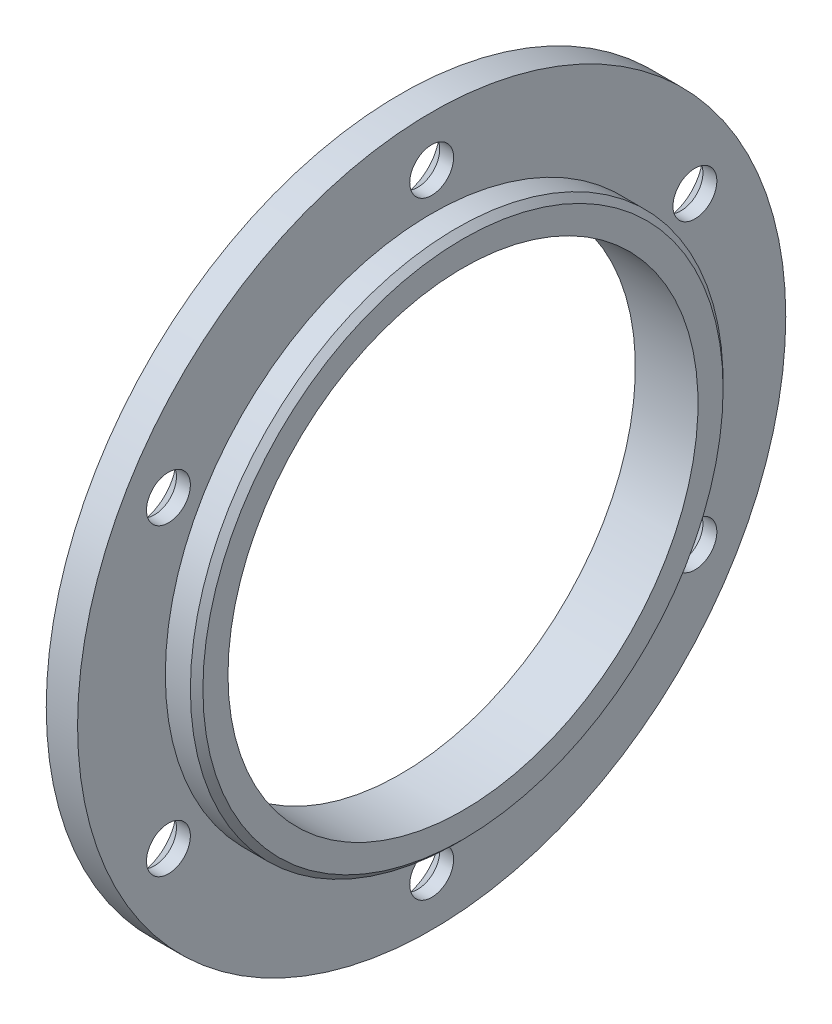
ISO-10303-21;
HEADER;
FILE_DESCRIPTION(('STEP AP214'),'2;1');
FILE_NAME('part.step','',(''),(''),'','','');
FILE_SCHEMA(('AUTOMOTIVE_DESIGN { 1 0 10303 214 1 1 1 1 }'));
ENDSEC;
DATA;
#1=APPLICATION_CONTEXT('core data for automotive mechanical design processes');
#2=APPLICATION_PROTOCOL_DEFINITION('international standard','automotive_design',2000,#1);
#3=PRODUCT_CONTEXT('',#1,'mechanical');
#4=PRODUCT('Part','Part','',(#3));
#5=PRODUCT_RELATED_PRODUCT_CATEGORY('part','',(#4));
#6=PRODUCT_DEFINITION_FORMATION('','',#4);
#7=PRODUCT_DEFINITION_CONTEXT('part definition',#1,'design');
#8=PRODUCT_DEFINITION('design','',#6,#7);
#9=PRODUCT_DEFINITION_SHAPE('','',#8);
#10=(LENGTH_UNIT() NAMED_UNIT(*) SI_UNIT(.MILLI.,.METRE.));
#11=(NAMED_UNIT(*) PLANE_ANGLE_UNIT() SI_UNIT($,.RADIAN.));
#12=(NAMED_UNIT(*) SI_UNIT($,.STERADIAN.) SOLID_ANGLE_UNIT());
#13=UNCERTAINTY_MEASURE_WITH_UNIT(LENGTH_MEASURE(1.E-05),#10,'distance_accuracy_value','');
#14=(GEOMETRIC_REPRESENTATION_CONTEXT(3) GLOBAL_UNCERTAINTY_ASSIGNED_CONTEXT((#13)) GLOBAL_UNIT_ASSIGNED_CONTEXT((#10,
#11,#12)) REPRESENTATION_CONTEXT('',''));
#15=CARTESIAN_POINT('',(0.,0.,0.));
#16=DIRECTION('',(0.,0.,1.));
#17=DIRECTION('',(1.,0.,0.));
#18=AXIS2_PLACEMENT_3D('',#15,#16,#17);
#19=CARTESIAN_POINT('',(0.,37.5,0.));
#20=DIRECTION('',(1.,0.,0.));
#21=DIRECTION('',(0.,0.,-1.));
#22=AXIS2_PLACEMENT_3D('',#19,#20,#21);
#23=PLANE('',#22);
#24=CARTESIAN_POINT('',(0.,24.2499999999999,42.0022320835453));
#25=DIRECTION('',(1.,0.,0.));
#26=DIRECTION('',(0.,0.,-1.));
#27=AXIS2_PLACEMENT_3D('',#24,#25,#26);
#28=CIRCLE('',#27,6.28000000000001);
#29=CARTESIAN_POINT('',(0.,24.2499999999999,35.7222320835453));
#30=VERTEX_POINT('',#29);
#31=EDGE_CURVE('E55',#30,#30,#28,.T.);
#32=ORIENTED_EDGE('',*,*,#31,.T.);
#33=EDGE_LOOP('',(#32));
#34=FACE_BOUND('',#33,.T.);
#35=CARTESIAN_POINT('',(0.,48.5,0.));
#36=DIRECTION('',(1.,0.,0.));
#37=DIRECTION('',(0.,0.,-1.));
#38=AXIS2_PLACEMENT_3D('',#35,#36,#37);
#39=CIRCLE('',#38,6.28000000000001);
#40=CARTESIAN_POINT('',(0.,48.5,6.28000000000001));
#41=VERTEX_POINT('',#40);
#42=EDGE_CURVE('E58',#41,#41,#39,.T.);
#43=ORIENTED_EDGE('',*,*,#42,.T.);
#44=EDGE_LOOP('',(#43));
#45=FACE_BOUND('',#44,.T.);
#46=CARTESIAN_POINT('',(0.,24.2500000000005,-42.002232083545));
#47=DIRECTION('',(1.,0.,0.));
#48=DIRECTION('',(0.,0.,-1.));
#49=AXIS2_PLACEMENT_3D('',#46,#47,#48);
#50=CIRCLE('',#49,6.28000000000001);
#51=CARTESIAN_POINT('',(0.,24.2500000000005,-35.722232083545));
#52=VERTEX_POINT('',#51);
#53=EDGE_CURVE('E61',#52,#52,#50,.T.);
#54=ORIENTED_EDGE('',*,*,#53,.T.);
#55=EDGE_LOOP('',(#54));
#56=FACE_BOUND('',#55,.T.);
#57=CARTESIAN_POINT('',(0.,-24.2499999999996,-42.0022320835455));
#58=DIRECTION('',(1.,0.,0.));
#59=DIRECTION('',(0.,0.,-1.));
#60=AXIS2_PLACEMENT_3D('',#57,#58,#59);
#61=CIRCLE('',#60,6.28);
#62=CARTESIAN_POINT('',(0.,-24.2499999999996,-35.7222320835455));
#63=VERTEX_POINT('',#62);
#64=EDGE_CURVE('E64',#63,#63,#61,.T.);
#65=ORIENTED_EDGE('',*,*,#64,.T.);
#66=EDGE_LOOP('',(#65));
#67=FACE_BOUND('',#66,.T.);
#68=CARTESIAN_POINT('',(0.,-24.2500000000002,42.0022320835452));
#69=DIRECTION('',(1.,0.,0.));
#70=DIRECTION('',(0.,0.,-1.));
#71=AXIS2_PLACEMENT_3D('',#68,#69,#70);
#72=CIRCLE('',#71,6.28000000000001);
#73=CARTESIAN_POINT('',(0.,-24.2500000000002,35.7222320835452));
#74=VERTEX_POINT('',#73);
#75=EDGE_CURVE('E67',#74,#74,#72,.T.);
#76=ORIENTED_EDGE('',*,*,#75,.T.);
#77=EDGE_LOOP('',(#76));
#78=FACE_BOUND('',#77,.T.);
#79=CARTESIAN_POINT('',(0.,-48.5,-3.3867388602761E-13));
#80=DIRECTION('',(1.,0.,0.));
#81=DIRECTION('',(0.,0.,-1.));
#82=AXIS2_PLACEMENT_3D('',#79,#80,#81);
#83=CIRCLE('',#82,6.28000000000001);
#84=CARTESIAN_POINT('',(0.,-48.5,6.27999999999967));
#85=VERTEX_POINT('',#84);
#86=EDGE_CURVE('E70',#85,#85,#83,.T.);
#87=ORIENTED_EDGE('',*,*,#86,.T.);
#88=EDGE_LOOP('',(#87));
#89=FACE_BOUND('',#88,.T.);
#90=CARTESIAN_POINT('',(0.,0.,0.));
#91=DIRECTION('',(-1.,0.,0.));
#92=DIRECTION('',(0.,0.,1.));
#93=AXIS2_PLACEMENT_3D('',#90,#91,#92);
#94=CIRCLE('',#93,37.5);
#95=CARTESIAN_POINT('',(0.,0.,37.5));
#96=VERTEX_POINT('',#95);
#97=EDGE_CURVE('E95',#96,#96,#94,.T.);
#98=ORIENTED_EDGE('',*,*,#97,.F.);
#99=EDGE_LOOP('',(#98));
#100=FACE_BOUND('',#99,.T.);
#101=CARTESIAN_POINT('',(0.,0.,0.));
#102=DIRECTION('',(-1.,0.,0.));
#103=DIRECTION('',(0.,0.,1.));
#104=AXIS2_PLACEMENT_3D('',#101,#102,#103);
#105=CIRCLE('',#104,56.5);
#106=CARTESIAN_POINT('',(0.,0.,56.5));
#107=VERTEX_POINT('',#106);
#108=EDGE_CURVE('E76',#107,#107,#105,.T.);
#109=ORIENTED_EDGE('',*,*,#108,.T.);
#110=EDGE_LOOP('',(#109));
#111=FACE_BOUND('',#110,.T.);
#112=ADVANCED_FACE('F32',(#34,#45,#56,#67,#78,#89,#100,#111),#23,.F.);
#113=CARTESIAN_POINT('',(-20.4243511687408,0.,0.));
#114=DIRECTION('',(-1.,0.,0.));
#115=DIRECTION('',(0.,0.,1.));
#116=AXIS2_PLACEMENT_3D('',#113,#114,#115);
#117=CYLINDRICAL_SURFACE('',#116,56.5);
#118=ORIENTED_EDGE('',*,*,#108,.F.);
#119=EDGE_LOOP('',(#118));
#120=FACE_BOUND('',#119,.T.);
#121=CARTESIAN_POINT('',(5.,0.,0.));
#122=DIRECTION('',(-1.,0.,0.));
#123=DIRECTION('',(0.,0.,1.));
#124=AXIS2_PLACEMENT_3D('',#121,#122,#123);
#125=CIRCLE('',#124,56.5);
#126=CARTESIAN_POINT('',(5.,0.,56.5));
#127=VERTEX_POINT('',#126);
#128=EDGE_CURVE('E98',#127,#127,#125,.T.);
#129=ORIENTED_EDGE('',*,*,#128,.T.);
#130=EDGE_LOOP('',(#129));
#131=FACE_BOUND('',#130,.T.);
#132=ADVANCED_FACE('F120',(#120,#131),#117,.T.);
#133=CARTESIAN_POINT('',(5.,42.5,0.));
#134=DIRECTION('',(-1.,0.,0.));
#135=DIRECTION('',(0.,0.,1.));
#136=AXIS2_PLACEMENT_3D('',#133,#134,#135);
#137=PLANE('',#136);
#138=CARTESIAN_POINT('',(5.,24.2500000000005,-42.002232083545));
#139=DIRECTION('',(-1.,0.,0.));
#140=DIRECTION('',(0.,0.,1.));
#141=AXIS2_PLACEMENT_3D('',#138,#139,#140);
#142=CIRCLE('',#141,3.5);
#143=CARTESIAN_POINT('',(5.,24.2500000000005,-38.502232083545));
#144=VERTEX_POINT('',#143);
#145=EDGE_CURVE('E77',#144,#144,#142,.T.);
#146=ORIENTED_EDGE('',*,*,#145,.T.);
#147=EDGE_LOOP('',(#146));
#148=FACE_BOUND('',#147,.T.);
#149=CARTESIAN_POINT('',(5.,-24.2499999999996,-42.0022320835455));
#150=DIRECTION('',(-1.,0.,0.));
#151=DIRECTION('',(0.,0.,1.));
#152=AXIS2_PLACEMENT_3D('',#149,#150,#151);
#153=CIRCLE('',#152,3.5);
#154=CARTESIAN_POINT('',(5.,-24.2499999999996,-38.5022320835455));
#155=VERTEX_POINT('',#154);
#156=EDGE_CURVE('E80',#155,#155,#153,.T.);
#157=ORIENTED_EDGE('',*,*,#156,.T.);
#158=EDGE_LOOP('',(#157));
#159=FACE_BOUND('',#158,.T.);
#160=CARTESIAN_POINT('',(5.,-48.5,-3.3867388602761E-13));
#161=DIRECTION('',(-1.,0.,0.));
#162=DIRECTION('',(0.,0.,1.));
#163=AXIS2_PLACEMENT_3D('',#160,#161,#162);
#164=CIRCLE('',#163,3.5);
#165=CARTESIAN_POINT('',(5.,-48.5,3.49999999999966));
#166=VERTEX_POINT('',#165);
#167=EDGE_CURVE('E83',#166,#166,#164,.T.);
#168=ORIENTED_EDGE('',*,*,#167,.T.);
#169=EDGE_LOOP('',(#168));
#170=FACE_BOUND('',#169,.T.);
#171=CARTESIAN_POINT('',(5.,-24.2500000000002,42.0022320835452));
#172=DIRECTION('',(-1.,0.,0.));
#173=DIRECTION('',(0.,0.,1.));
#174=AXIS2_PLACEMENT_3D('',#171,#172,#173);
#175=CIRCLE('',#174,3.5);
#176=CARTESIAN_POINT('',(5.,-24.2500000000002,45.5022320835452));
#177=VERTEX_POINT('',#176);
#178=EDGE_CURVE('E86',#177,#177,#175,.T.);
#179=ORIENTED_EDGE('',*,*,#178,.T.);
#180=EDGE_LOOP('',(#179));
#181=FACE_BOUND('',#180,.T.);
#182=CARTESIAN_POINT('',(5.,24.2499999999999,42.0022320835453));
#183=DIRECTION('',(-1.,0.,0.));
#184=DIRECTION('',(0.,0.,1.));
#185=AXIS2_PLACEMENT_3D('',#182,#183,#184);
#186=CIRCLE('',#185,3.50000000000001);
#187=CARTESIAN_POINT('',(5.,24.2499999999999,45.5022320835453));
#188=VERTEX_POINT('',#187);
#189=EDGE_CURVE('E89',#188,#188,#186,.T.);
#190=ORIENTED_EDGE('',*,*,#189,.T.);
#191=EDGE_LOOP('',(#190));
#192=FACE_BOUND('',#191,.T.);
#193=CARTESIAN_POINT('',(5.,48.5,0.));
#194=DIRECTION('',(-1.,0.,0.));
#195=DIRECTION('',(0.,0.,1.));
#196=AXIS2_PLACEMENT_3D('',#193,#194,#195);
#197=CIRCLE('',#196,3.5);
#198=CARTESIAN_POINT('',(5.,48.5,3.5));
#199=VERTEX_POINT('',#198);
#200=EDGE_CURVE('E92',#199,#199,#197,.T.);
#201=ORIENTED_EDGE('',*,*,#200,.T.);
#202=EDGE_LOOP('',(#201));
#203=FACE_BOUND('',#202,.T.);
#204=ORIENTED_EDGE('',*,*,#128,.F.);
#205=EDGE_LOOP('',(#204));
#206=FACE_BOUND('',#205,.T.);
#207=CARTESIAN_POINT('',(5.,0.,0.));
#208=DIRECTION('',(-1.,0.,0.));
#209=DIRECTION('',(0.,0.,1.));
#210=AXIS2_PLACEMENT_3D('',#207,#208,#209);
#211=CIRCLE('',#210,42.5);
#212=CARTESIAN_POINT('',(5.,0.,42.5));
#213=VERTEX_POINT('',#212);
#214=EDGE_CURVE('E101',#213,#213,#211,.T.);
#215=ORIENTED_EDGE('',*,*,#214,.T.);
#216=EDGE_LOOP('',(#215));
#217=FACE_BOUND('',#216,.T.);
#218=ADVANCED_FACE('F127',(#148,#159,#170,#181,#192,#203,#206,#217),#137,.F.);
#219=CARTESIAN_POINT('',(-20.4243511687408,0.,0.));
#220=DIRECTION('',(-1.,0.,0.));
#221=DIRECTION('',(0.,0.,1.));
#222=AXIS2_PLACEMENT_3D('',#219,#220,#221);
#223=CYLINDRICAL_SURFACE('',#222,42.5);
#224=ORIENTED_EDGE('',*,*,#214,.F.);
#225=EDGE_LOOP('',(#224));
#226=FACE_BOUND('',#225,.T.);
#227=CARTESIAN_POINT('',(9.,0.,0.));
#228=DIRECTION('',(-1.,0.,0.));
#229=DIRECTION('',(0.,0.,1.));
#230=AXIS2_PLACEMENT_3D('',#227,#228,#229);
#231=CIRCLE('',#230,42.5);
#232=CARTESIAN_POINT('',(9.,0.,42.5));
#233=VERTEX_POINT('',#232);
#234=EDGE_CURVE('E104',#233,#233,#231,.T.);
#235=ORIENTED_EDGE('',*,*,#234,.T.);
#236=EDGE_LOOP('',(#235));
#237=FACE_BOUND('',#236,.T.);
#238=ADVANCED_FACE('F133',(#226,#237),#223,.T.);
#239=CARTESIAN_POINT('',(10.,0.,0.));
#240=DIRECTION('',(-1.,0.,0.));
#241=DIRECTION('',(0.,0.,1.));
#242=AXIS2_PLACEMENT_3D('',#239,#240,#241);
#243=CONICAL_SURFACE('',#242,41.5,0.785398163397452);
#244=ORIENTED_EDGE('',*,*,#234,.F.);
#245=EDGE_LOOP('',(#244));
#246=FACE_BOUND('',#245,.T.);
#247=CARTESIAN_POINT('',(10.,0.,0.));
#248=DIRECTION('',(-1.,0.,0.));
#249=DIRECTION('',(0.,0.,1.));
#250=AXIS2_PLACEMENT_3D('',#247,#248,#249);
#251=CIRCLE('',#250,41.5);
#252=CARTESIAN_POINT('',(10.,0.,41.5));
#253=VERTEX_POINT('',#252);
#254=EDGE_CURVE('E107',#253,#253,#251,.T.);
#255=ORIENTED_EDGE('',*,*,#254,.T.);
#256=EDGE_LOOP('',(#255));
#257=FACE_BOUND('',#256,.T.);
#258=ADVANCED_FACE('F140',(#246,#257),#243,.T.);
#259=CARTESIAN_POINT('',(10.,41.5,0.));
#260=DIRECTION('',(-1.,0.,0.));
#261=DIRECTION('',(0.,0.,1.));
#262=AXIS2_PLACEMENT_3D('',#259,#260,#261);
#263=PLANE('',#262);
#264=ORIENTED_EDGE('',*,*,#254,.F.);
#265=EDGE_LOOP('',(#264));
#266=FACE_BOUND('',#265,.T.);
#267=CARTESIAN_POINT('',(10.,0.,0.));
#268=DIRECTION('',(-1.,0.,0.));
#269=DIRECTION('',(0.,0.,1.));
#270=AXIS2_PLACEMENT_3D('',#267,#268,#269);
#271=CIRCLE('',#270,37.5);
#272=CARTESIAN_POINT('',(10.,0.,37.5));
#273=VERTEX_POINT('',#272);
#274=EDGE_CURVE('E110',#273,#273,#271,.T.);
#275=ORIENTED_EDGE('',*,*,#274,.T.);
#276=EDGE_LOOP('',(#275));
#277=FACE_BOUND('',#276,.T.);
#278=ADVANCED_FACE('F146',(#266,#277),#263,.F.);
#279=CARTESIAN_POINT('',(-20.4243511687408,0.,0.));
#280=DIRECTION('',(-1.,0.,0.));
#281=DIRECTION('',(0.,0.,1.));
#282=AXIS2_PLACEMENT_3D('',#279,#280,#281);
#283=CYLINDRICAL_SURFACE('',#282,37.5);
#284=ORIENTED_EDGE('',*,*,#274,.F.);
#285=EDGE_LOOP('',(#284));
#286=FACE_BOUND('',#285,.T.);
#287=ORIENTED_EDGE('',*,*,#97,.T.);
#288=EDGE_LOOP('',(#287));
#289=FACE_BOUND('',#288,.T.);
#290=ADVANCED_FACE('F116',(#286,#289),#283,.F.);
#291=CARTESIAN_POINT('',(9.,48.5,0.));
#292=DIRECTION('',(-1.,0.,0.));
#293=DIRECTION('',(0.,0.,1.));
#294=AXIS2_PLACEMENT_3D('',#291,#292,#293);
#295=CYLINDRICAL_SURFACE('',#294,3.5);
#296=CARTESIAN_POINT('',(2.78,48.5,0.));
#297=DIRECTION('',(1.,0.,0.));
#298=DIRECTION('',(0.,0.,-1.));
#299=AXIS2_PLACEMENT_3D('',#296,#297,#298);
#300=CIRCLE('',#299,3.5);
#301=CARTESIAN_POINT('',(2.78,48.5,3.5));
#302=VERTEX_POINT('',#301);
#303=EDGE_CURVE('E52',#302,#302,#300,.F.);
#304=ORIENTED_EDGE('',*,*,#303,.T.);
#305=EDGE_LOOP('',(#304));
#306=FACE_BOUND('',#305,.T.);
#307=ORIENTED_EDGE('',*,*,#200,.F.);
#308=EDGE_LOOP('',(#307));
#309=FACE_BOUND('',#308,.T.);
#310=ADVANCED_FACE('F156',(#306,#309),#295,.F.);
#311=CARTESIAN_POINT('',(9.,24.2499999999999,42.0022320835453));
#312=DIRECTION('',(-1.,0.,0.));
#313=DIRECTION('',(0.,0.,1.));
#314=AXIS2_PLACEMENT_3D('',#311,#312,#313);
#315=CYLINDRICAL_SURFACE('',#314,3.50000000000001);
#316=CARTESIAN_POINT('',(2.78,24.2499999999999,42.0022320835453));
#317=DIRECTION('',(1.,0.,0.));
#318=DIRECTION('',(0.,0.,-1.));
#319=AXIS2_PLACEMENT_3D('',#316,#317,#318);
#320=CIRCLE('',#319,3.50000000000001);
#321=CARTESIAN_POINT('',(2.78,24.2499999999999,38.5022320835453));
#322=VERTEX_POINT('',#321);
#323=EDGE_CURVE('E73',#322,#322,#320,.F.);
#324=ORIENTED_EDGE('',*,*,#323,.T.);
#325=EDGE_LOOP('',(#324));
#326=FACE_BOUND('',#325,.T.);
#327=ORIENTED_EDGE('',*,*,#189,.F.);
#328=EDGE_LOOP('',(#327));
#329=FACE_BOUND('',#328,.T.);
#330=ADVANCED_FACE('F161',(#326,#329),#315,.F.);
#331=CARTESIAN_POINT('',(9.,-24.2500000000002,42.0022320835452));
#332=DIRECTION('',(-1.,0.,0.));
#333=DIRECTION('',(0.,0.,1.));
#334=AXIS2_PLACEMENT_3D('',#331,#332,#333);
#335=CYLINDRICAL_SURFACE('',#334,3.5);
#336=CARTESIAN_POINT('',(2.78,-24.2500000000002,42.0022320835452));
#337=DIRECTION('',(1.,0.,0.));
#338=DIRECTION('',(0.,0.,-1.));
#339=AXIS2_PLACEMENT_3D('',#336,#337,#338);
#340=CIRCLE('',#339,3.5);
#341=CARTESIAN_POINT('',(2.78,-24.2500000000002,38.5022320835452));
#342=VERTEX_POINT('',#341);
#343=EDGE_CURVE('E39',#342,#342,#340,.F.);
#344=ORIENTED_EDGE('',*,*,#343,.T.);
#345=EDGE_LOOP('',(#344));
#346=FACE_BOUND('',#345,.T.);
#347=ORIENTED_EDGE('',*,*,#178,.F.);
#348=EDGE_LOOP('',(#347));
#349=FACE_BOUND('',#348,.T.);
#350=ADVANCED_FACE('F254',(#346,#349),#335,.F.);
#351=CARTESIAN_POINT('',(9.,-48.5,-3.3867388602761E-13));
#352=DIRECTION('',(-1.,0.,0.));
#353=DIRECTION('',(0.,0.,1.));
#354=AXIS2_PLACEMENT_3D('',#351,#352,#353);
#355=CYLINDRICAL_SURFACE('',#354,3.5);
#356=CARTESIAN_POINT('',(2.78,-48.5,-3.3867388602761E-13));
#357=DIRECTION('',(1.,0.,0.));
#358=DIRECTION('',(0.,0.,-1.));
#359=AXIS2_PLACEMENT_3D('',#356,#357,#358);
#360=CIRCLE('',#359,3.5);
#361=CARTESIAN_POINT('',(2.78,-48.5,3.49999999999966));
#362=VERTEX_POINT('',#361);
#363=EDGE_CURVE('E10',#362,#362,#360,.F.);
#364=ORIENTED_EDGE('',*,*,#363,.T.);
#365=EDGE_LOOP('',(#364));
#366=FACE_BOUND('',#365,.T.);
#367=ORIENTED_EDGE('',*,*,#167,.F.);
#368=EDGE_LOOP('',(#367));
#369=FACE_BOUND('',#368,.T.);
#370=ADVANCED_FACE('F244',(#366,#369),#355,.F.);
#371=CARTESIAN_POINT('',(9.,-24.2499999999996,-42.0022320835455));
#372=DIRECTION('',(-1.,0.,0.));
#373=DIRECTION('',(0.,0.,1.));
#374=AXIS2_PLACEMENT_3D('',#371,#372,#373);
#375=CYLINDRICAL_SURFACE('',#374,3.5);
#376=CARTESIAN_POINT('',(2.78000000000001,-24.2499999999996,-42.0022320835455));
#377=DIRECTION('',(1.,0.,0.));
#378=DIRECTION('',(0.,0.,-1.));
#379=AXIS2_PLACEMENT_3D('',#376,#377,#378);
#380=CIRCLE('',#379,3.5);
#381=CARTESIAN_POINT('',(2.78000000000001,-24.2499999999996,-38.5022320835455));
#382=VERTEX_POINT('',#381);
#383=EDGE_CURVE('E43',#382,#382,#380,.F.);
#384=ORIENTED_EDGE('',*,*,#383,.T.);
#385=EDGE_LOOP('',(#384));
#386=FACE_BOUND('',#385,.T.);
#387=ORIENTED_EDGE('',*,*,#156,.F.);
#388=EDGE_LOOP('',(#387));
#389=FACE_BOUND('',#388,.T.);
#390=ADVANCED_FACE('F234',(#386,#389),#375,.F.);
#391=CARTESIAN_POINT('',(9.,24.2500000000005,-42.002232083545));
#392=DIRECTION('',(-1.,0.,0.));
#393=DIRECTION('',(0.,0.,1.));
#394=AXIS2_PLACEMENT_3D('',#391,#392,#393);
#395=CYLINDRICAL_SURFACE('',#394,3.5);
#396=CARTESIAN_POINT('',(2.78000000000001,24.2500000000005,-42.002232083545));
#397=DIRECTION('',(1.,0.,0.));
#398=DIRECTION('',(0.,0.,-1.));
#399=AXIS2_PLACEMENT_3D('',#396,#397,#398);
#400=CIRCLE('',#399,3.5);
#401=CARTESIAN_POINT('',(2.78000000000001,24.2500000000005,-38.502232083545));
#402=VERTEX_POINT('',#401);
#403=EDGE_CURVE('E47',#402,#402,#400,.F.);
#404=ORIENTED_EDGE('',*,*,#403,.T.);
#405=EDGE_LOOP('',(#404));
#406=FACE_BOUND('',#405,.T.);
#407=ORIENTED_EDGE('',*,*,#145,.F.);
#408=EDGE_LOOP('',(#407));
#409=FACE_BOUND('',#408,.T.);
#410=ADVANCED_FACE('F170',(#406,#409),#395,.F.);
#411=CARTESIAN_POINT('',(2.78,24.2499999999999,42.0022320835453));
#412=DIRECTION('',(-1.,0.,0.));
#413=DIRECTION('',(0.,0.,1.));
#414=AXIS2_PLACEMENT_3D('',#411,#412,#413);
#415=CONICAL_SURFACE('',#414,3.50000000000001,0.785398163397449);
#416=ORIENTED_EDGE('',*,*,#31,.F.);
#417=EDGE_LOOP('',(#416));
#418=FACE_BOUND('',#417,.T.);
#419=ORIENTED_EDGE('',*,*,#323,.F.);
#420=EDGE_LOOP('',(#419));
#421=FACE_BOUND('',#420,.T.);
#422=ADVANCED_FACE('F166',(#418,#421),#415,.F.);
#423=CARTESIAN_POINT('',(2.78,48.5,0.));
#424=DIRECTION('',(-1.,0.,0.));
#425=DIRECTION('',(0.,0.,1.));
#426=AXIS2_PLACEMENT_3D('',#423,#424,#425);
#427=CONICAL_SURFACE('',#426,3.5,0.785398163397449);
#428=CARTESIAN_POINT('',(0.,48.5,6.28000000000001));
#429=CARTESIAN_POINT('',(0.0289583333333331,48.5,6.25104166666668));
#430=CARTESIAN_POINT('',(0.0579166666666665,48.5,6.22208333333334));
#431=CARTESIAN_POINT('',(0.115833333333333,48.5,6.16416666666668));
#432=CARTESIAN_POINT('',(0.144791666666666,48.5,6.13520833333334));
#433=CARTESIAN_POINT('',(0.202708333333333,48.5,6.07729166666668));
#434=CARTESIAN_POINT('',(0.231666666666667,48.5,6.04833333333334));
#435=CARTESIAN_POINT('',(0.289583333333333,48.5,5.99041666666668));
#436=CARTESIAN_POINT('',(0.318541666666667,48.5,5.96145833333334));
#437=CARTESIAN_POINT('',(0.376458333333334,48.5,5.90354166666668));
#438=CARTESIAN_POINT('',(0.405416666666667,48.5,5.87458333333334));
#439=CARTESIAN_POINT('',(0.463333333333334,48.5,5.81666666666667));
#440=CARTESIAN_POINT('',(0.492291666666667,48.5,5.78770833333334));
#441=CARTESIAN_POINT('',(0.550208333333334,48.5,5.72979166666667));
#442=CARTESIAN_POINT('',(0.579166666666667,48.5,5.70083333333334));
#443=CARTESIAN_POINT('',(0.637083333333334,48.5,5.64291666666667));
#444=CARTESIAN_POINT('',(0.666041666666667,48.5,5.61395833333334));
#445=CARTESIAN_POINT('',(0.723958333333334,48.5,5.55604166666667));
#446=CARTESIAN_POINT('',(0.752916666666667,48.5,5.52708333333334));
#447=CARTESIAN_POINT('',(0.810833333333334,48.5,5.46916666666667));
#448=CARTESIAN_POINT('',(0.839791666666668,48.5,5.44020833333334));
#449=CARTESIAN_POINT('',(0.897708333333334,48.5,5.38229166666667));
#450=CARTESIAN_POINT('',(0.926666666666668,48.5,5.35333333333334));
#451=CARTESIAN_POINT('',(0.984583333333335,48.5,5.29541666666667));
#452=CARTESIAN_POINT('',(1.01354166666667,48.5,5.26645833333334));
#453=CARTESIAN_POINT('',(1.07145833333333,48.5,5.20854166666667));
#454=CARTESIAN_POINT('',(1.10041666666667,48.5,5.17958333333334));
#455=CARTESIAN_POINT('',(1.15833333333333,48.5,5.12166666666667));
#456=CARTESIAN_POINT('',(1.18729166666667,48.5,5.09270833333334));
#457=CARTESIAN_POINT('',(1.24520833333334,48.5,5.03479166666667));
#458=CARTESIAN_POINT('',(1.27416666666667,48.5,5.00583333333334));
#459=CARTESIAN_POINT('',(1.33208333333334,48.5,4.94791666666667));
#460=CARTESIAN_POINT('',(1.36104166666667,48.5,4.91895833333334));
#461=CARTESIAN_POINT('',(1.41895833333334,48.5,4.86104166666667));
#462=CARTESIAN_POINT('',(1.44791666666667,48.5,4.83208333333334));
#463=CARTESIAN_POINT('',(1.50583333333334,48.5,4.77416666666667));
#464=CARTESIAN_POINT('',(1.53479166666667,48.5,4.74520833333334));
#465=CARTESIAN_POINT('',(1.59270833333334,48.5,4.68729166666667));
#466=CARTESIAN_POINT('',(1.62166666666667,48.5,4.65833333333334));
#467=CARTESIAN_POINT('',(1.67958333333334,48.5,4.60041666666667));
#468=CARTESIAN_POINT('',(1.70854166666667,48.5,4.57145833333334));
#469=CARTESIAN_POINT('',(1.76645833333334,48.5,4.51354166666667));
#470=CARTESIAN_POINT('',(1.79541666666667,48.5,4.48458333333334));
#471=CARTESIAN_POINT('',(1.85333333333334,48.5,4.42666666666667));
#472=CARTESIAN_POINT('',(1.88229166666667,48.5,4.39770833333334));
#473=CARTESIAN_POINT('',(1.94020833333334,48.5,4.33979166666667));
#474=CARTESIAN_POINT('',(1.96916666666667,48.5,4.31083333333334));
#475=CARTESIAN_POINT('',(2.02708333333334,48.5,4.25291666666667));
#476=CARTESIAN_POINT('',(2.05604166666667,48.5,4.22395833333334));
#477=CARTESIAN_POINT('',(2.11395833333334,48.5,4.16604166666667));
#478=CARTESIAN_POINT('',(2.14291666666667,48.5,4.13708333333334));
#479=CARTESIAN_POINT('',(2.20083333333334,48.5,4.07916666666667));
#480=CARTESIAN_POINT('',(2.22979166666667,48.5,4.05020833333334));
#481=CARTESIAN_POINT('',(2.28770833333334,48.5,3.99229166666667));
#482=CARTESIAN_POINT('',(2.31666666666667,48.5,3.96333333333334));
#483=CARTESIAN_POINT('',(2.37458333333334,48.5,3.90541666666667));
#484=CARTESIAN_POINT('',(2.40354166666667,48.5,3.87645833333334));
#485=CARTESIAN_POINT('',(2.46145833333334,48.5,3.81854166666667));
#486=CARTESIAN_POINT('',(2.49041666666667,48.5,3.78958333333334));
#487=CARTESIAN_POINT('',(2.54833333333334,48.5,3.73166666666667));
#488=CARTESIAN_POINT('',(2.57729166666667,48.5,3.70270833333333));
#489=CARTESIAN_POINT('',(2.63520833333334,48.5,3.64479166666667));
#490=CARTESIAN_POINT('',(2.66416666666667,48.5,3.61583333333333));
#491=CARTESIAN_POINT('',(2.72208333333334,48.5,3.55791666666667));
#492=CARTESIAN_POINT('',(2.75104166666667,48.5,3.52895833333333));
#493=CARTESIAN_POINT('',(2.78,48.5,3.5));
#494=B_SPLINE_CURVE_WITH_KNOTS('',3,(#428,#429,#430,#431,#432,#433,#434,#435,#436,#437,#438,
#439,#440,#441,#442,#443,#444,#445,#446,#447,#448,#449,#450,#451,#452,#453,#454,#455,#456,#457,
#458,#459,#460,#461,#462,#463,#464,#465,#466,#467,#468,#469,#470,#471,#472,#473,#474,#475,#476,
#477,#478,#479,#480,#481,#482,#483,#484,#485,#486,#487,#488,#489,#490,#491,#492,#493),
.UNSPECIFIED.,.F.,.F.,(4,2,2,2,2,2,2,2,2,2,2,2,2,2,2,2,2,2,2,2,2,2,2,2,2,2,2,2,2,2,2,2,4),(0.,
0.122859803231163,0.245719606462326,0.368579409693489,0.491439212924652,0.614299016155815,
0.737158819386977,0.860018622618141,0.982878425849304,1.10573822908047,1.22859803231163,
1.35145783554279,1.47431763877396,1.59717744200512,1.72003724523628,1.84289704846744,
1.96575685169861,2.08861665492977,2.21147645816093,2.3343362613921,2.45719606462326,
2.58005586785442,2.70291567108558,2.82577547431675,2.94863527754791,3.07149508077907,
3.19435488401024,3.3172146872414,3.44007449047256,3.56293429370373,3.68579409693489,
3.80865390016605,3.93151370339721),.UNSPECIFIED.);
#495=EDGE_CURVE('BSEAM169',#41,#302,#494,.T.);
#496=ORIENTED_EDGE('',*,*,#42,.F.);
#497=ORIENTED_EDGE('',*,*,#303,.F.);
#498=ORIENTED_EDGE('',*,*,#495,.T.);
#499=ORIENTED_EDGE('',*,*,#495,.F.);
#500=EDGE_LOOP('',(#496,#498,#497,#499));
#501=FACE_BOUND('',#500,.T.);
#502=ADVANCED_FACE('F169',(#501),#427,.F.);
#503=CARTESIAN_POINT('',(2.78000000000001,24.2500000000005,-42.002232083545));
#504=DIRECTION('',(-1.,0.,0.));
#505=DIRECTION('',(0.,0.,1.));
#506=AXIS2_PLACEMENT_3D('',#503,#504,#505);
#507=CONICAL_SURFACE('',#506,3.5,0.785398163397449);
#508=CARTESIAN_POINT('',(0.,24.2500000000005,-35.722232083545));
#509=CARTESIAN_POINT('',(0.0289583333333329,24.2500000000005,-35.7511904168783));
#510=CARTESIAN_POINT('',(0.0579166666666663,24.2500000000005,-35.7801487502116));
#511=CARTESIAN_POINT('',(0.115833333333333,24.2500000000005,-35.8380654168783));
#512=CARTESIAN_POINT('',(0.144791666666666,24.2500000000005,-35.8670237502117));
#513=CARTESIAN_POINT('',(0.202708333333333,24.2500000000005,-35.9249404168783));
#514=CARTESIAN_POINT('',(0.231666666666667,24.2500000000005,-35.9538987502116));
#515=CARTESIAN_POINT('',(0.289583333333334,24.2500000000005,-36.0118154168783));
#516=CARTESIAN_POINT('',(0.318541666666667,24.2500000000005,-36.0407737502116));
#517=CARTESIAN_POINT('',(0.376458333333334,24.2500000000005,-36.0986904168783));
#518=CARTESIAN_POINT('',(0.405416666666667,24.2500000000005,-36.1276487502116));
#519=CARTESIAN_POINT('',(0.463333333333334,24.2500000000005,-36.1855654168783));
#520=CARTESIAN_POINT('',(0.492291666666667,24.2500000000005,-36.2145237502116));
#521=CARTESIAN_POINT('',(0.550208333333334,24.2500000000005,-36.2724404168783));
#522=CARTESIAN_POINT('',(0.579166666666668,24.2500000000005,-36.3013987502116));
#523=CARTESIAN_POINT('',(0.637083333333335,24.2500000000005,-36.3593154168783));
#524=CARTESIAN_POINT('',(0.666041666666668,24.2500000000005,-36.3882737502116));
#525=CARTESIAN_POINT('',(0.723958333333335,24.2500000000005,-36.4461904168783));
#526=CARTESIAN_POINT('',(0.752916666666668,24.2500000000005,-36.4751487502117));
#527=CARTESIAN_POINT('',(0.810833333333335,24.2500000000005,-36.5330654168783));
#528=CARTESIAN_POINT('',(0.839791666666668,24.2500000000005,-36.5620237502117));
#529=CARTESIAN_POINT('',(0.897708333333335,24.2500000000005,-36.6199404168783));
#530=CARTESIAN_POINT('',(0.926666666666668,24.2500000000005,-36.6488987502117));
#531=CARTESIAN_POINT('',(0.984583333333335,24.2500000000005,-36.7068154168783));
#532=CARTESIAN_POINT('',(1.01354166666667,24.2500000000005,-36.7357737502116));
#533=CARTESIAN_POINT('',(1.07145833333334,24.2500000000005,-36.7936904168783));
#534=CARTESIAN_POINT('',(1.10041666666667,24.2500000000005,-36.8226487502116));
#535=CARTESIAN_POINT('',(1.15833333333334,24.2500000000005,-36.8805654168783));
#536=CARTESIAN_POINT('',(1.18729166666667,24.2500000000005,-36.9095237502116));
#537=CARTESIAN_POINT('',(1.24520833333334,24.2500000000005,-36.9674404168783));
#538=CARTESIAN_POINT('',(1.27416666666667,24.2500000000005,-36.9963987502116));
#539=CARTESIAN_POINT('',(1.33208333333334,24.2500000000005,-37.0543154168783));
#540=CARTESIAN_POINT('',(1.36104166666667,24.2500000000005,-37.0832737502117));
#541=CARTESIAN_POINT('',(1.41895833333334,24.2500000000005,-37.1411904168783));
#542=CARTESIAN_POINT('',(1.44791666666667,24.2500000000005,-37.1701487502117));
#543=CARTESIAN_POINT('',(1.50583333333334,24.2500000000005,-37.2280654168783));
#544=CARTESIAN_POINT('',(1.53479166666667,24.2500000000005,-37.2570237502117));
#545=CARTESIAN_POINT('',(1.59270833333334,24.2500000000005,-37.3149404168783));
#546=CARTESIAN_POINT('',(1.62166666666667,24.2500000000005,-37.3438987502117));
#547=CARTESIAN_POINT('',(1.67958333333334,24.2500000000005,-37.4018154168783));
#548=CARTESIAN_POINT('',(1.70854166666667,24.2500000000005,-37.4307737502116));
#549=CARTESIAN_POINT('',(1.76645833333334,24.2500000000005,-37.4886904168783));
#550=CARTESIAN_POINT('',(1.79541666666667,24.2500000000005,-37.5176487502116));
#551=CARTESIAN_POINT('',(1.85333333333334,24.2500000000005,-37.5755654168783));
#552=CARTESIAN_POINT('',(1.88229166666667,24.2500000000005,-37.6045237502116));
#553=CARTESIAN_POINT('',(1.94020833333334,24.2500000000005,-37.6624404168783));
#554=CARTESIAN_POINT('',(1.96916666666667,24.2500000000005,-37.6913987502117));
#555=CARTESIAN_POINT('',(2.02708333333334,24.2500000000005,-37.7493154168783));
#556=CARTESIAN_POINT('',(2.05604166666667,24.2500000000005,-37.7782737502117));
#557=CARTESIAN_POINT('',(2.11395833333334,24.2500000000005,-37.8361904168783));
#558=CARTESIAN_POINT('',(2.14291666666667,24.2500000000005,-37.8651487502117));
#559=CARTESIAN_POINT('',(2.20083333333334,24.2500000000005,-37.9230654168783));
#560=CARTESIAN_POINT('',(2.22979166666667,24.2500000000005,-37.9520237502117));
#561=CARTESIAN_POINT('',(2.28770833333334,24.2500000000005,-38.0099404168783));
#562=CARTESIAN_POINT('',(2.31666666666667,24.2500000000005,-38.0388987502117));
#563=CARTESIAN_POINT('',(2.37458333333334,24.2500000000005,-38.0968154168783));
#564=CARTESIAN_POINT('',(2.40354166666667,24.2500000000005,-38.1257737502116));
#565=CARTESIAN_POINT('',(2.46145833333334,24.2500000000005,-38.1836904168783));
#566=CARTESIAN_POINT('',(2.49041666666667,24.2500000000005,-38.2126487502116));
#567=CARTESIAN_POINT('',(2.54833333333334,24.2500000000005,-38.2705654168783));
#568=CARTESIAN_POINT('',(2.57729166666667,24.2500000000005,-38.2995237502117));
#569=CARTESIAN_POINT('',(2.63520833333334,24.2500000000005,-38.3574404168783));
#570=CARTESIAN_POINT('',(2.66416666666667,24.2500000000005,-38.3863987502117));
#571=CARTESIAN_POINT('',(2.72208333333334,24.2500000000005,-38.4443154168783));
#572=CARTESIAN_POINT('',(2.75104166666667,24.2500000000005,-38.4732737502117));
#573=CARTESIAN_POINT('',(2.78000000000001,24.2500000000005,-38.502232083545));
#574=B_SPLINE_CURVE_WITH_KNOTS('',3,(#508,#509,#510,#511,#512,#513,#514,#515,#516,#517,#518,
#519,#520,#521,#522,#523,#524,#525,#526,#527,#528,#529,#530,#531,#532,#533,#534,#535,#536,#537,
#538,#539,#540,#541,#542,#543,#544,#545,#546,#547,#548,#549,#550,#551,#552,#553,#554,#555,#556,
#557,#558,#559,#560,#561,#562,#563,#564,#565,#566,#567,#568,#569,#570,#571,#572,#573),
.UNSPECIFIED.,.F.,.F.,(4,2,2,2,2,2,2,2,2,2,2,2,2,2,2,2,2,2,2,2,2,2,2,2,2,2,2,2,2,2,2,2,4),(0.,
0.122859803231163,0.245719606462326,0.368579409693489,0.491439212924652,0.614299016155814,
0.737158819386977,0.86001862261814,0.982878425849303,1.10573822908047,1.22859803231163,
1.35145783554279,1.47431763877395,1.59717744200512,1.72003724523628,1.84289704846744,
1.96575685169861,2.08861665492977,2.21147645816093,2.3343362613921,2.45719606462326,
2.58005586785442,2.70291567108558,2.82577547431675,2.94863527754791,3.07149508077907,
3.19435488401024,3.3172146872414,3.44007449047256,3.56293429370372,3.68579409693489,
3.80865390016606,3.93151370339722),.UNSPECIFIED.);
#575=EDGE_CURVE('BSEAM174',#52,#402,#574,.T.);
#576=ORIENTED_EDGE('',*,*,#53,.F.);
#577=ORIENTED_EDGE('',*,*,#403,.F.);
#578=ORIENTED_EDGE('',*,*,#575,.T.);
#579=ORIENTED_EDGE('',*,*,#575,.F.);
#580=EDGE_LOOP('',(#576,#578,#577,#579));
#581=FACE_BOUND('',#580,.T.);
#582=ADVANCED_FACE('F174',(#581),#507,.F.);
#583=CARTESIAN_POINT('',(2.78000000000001,-24.2499999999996,-42.0022320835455));
#584=DIRECTION('',(-1.,0.,0.));
#585=DIRECTION('',(0.,0.,1.));
#586=AXIS2_PLACEMENT_3D('',#583,#584,#585);
#587=CONICAL_SURFACE('',#586,3.5,0.785398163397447);
#588=CARTESIAN_POINT('',(0.,-24.2499999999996,-35.7222320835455));
#589=CARTESIAN_POINT('',(0.0289583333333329,-24.2499999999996,-35.7511904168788));
#590=CARTESIAN_POINT('',(0.0579166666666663,-24.2499999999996,-35.7801487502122));
#591=CARTESIAN_POINT('',(0.115833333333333,-24.2499999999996,-35.8380654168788));
#592=CARTESIAN_POINT('',(0.144791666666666,-24.2499999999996,-35.8670237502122));
#593=CARTESIAN_POINT('',(0.202708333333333,-24.2499999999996,-35.9249404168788));
#594=CARTESIAN_POINT('',(0.231666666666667,-24.2499999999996,-35.9538987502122));
#595=CARTESIAN_POINT('',(0.289583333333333,-24.2499999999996,-36.0118154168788));
#596=CARTESIAN_POINT('',(0.318541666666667,-24.2499999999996,-36.0407737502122));
#597=CARTESIAN_POINT('',(0.376458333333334,-24.2499999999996,-36.0986904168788));
#598=CARTESIAN_POINT('',(0.405416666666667,-24.2499999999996,-36.1276487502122));
#599=CARTESIAN_POINT('',(0.463333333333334,-24.2499999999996,-36.1855654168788));
#600=CARTESIAN_POINT('',(0.492291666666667,-24.2499999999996,-36.2145237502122));
#601=CARTESIAN_POINT('',(0.550208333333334,-24.2499999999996,-36.2724404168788));
#602=CARTESIAN_POINT('',(0.579166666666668,-24.2499999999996,-36.3013987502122));
#603=CARTESIAN_POINT('',(0.637083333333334,-24.2499999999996,-36.3593154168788));
#604=CARTESIAN_POINT('',(0.666041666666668,-24.2499999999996,-36.3882737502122));
#605=CARTESIAN_POINT('',(0.723958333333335,-24.2499999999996,-36.4461904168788));
#606=CARTESIAN_POINT('',(0.752916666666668,-24.2499999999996,-36.4751487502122));
#607=CARTESIAN_POINT('',(0.810833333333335,-24.2499999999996,-36.5330654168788));
#608=CARTESIAN_POINT('',(0.839791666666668,-24.2499999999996,-36.5620237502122));
#609=CARTESIAN_POINT('',(0.897708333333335,-24.2499999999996,-36.6199404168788));
#610=CARTESIAN_POINT('',(0.926666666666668,-24.2499999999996,-36.6488987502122));
#611=CARTESIAN_POINT('',(0.984583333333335,-24.2499999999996,-36.7068154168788));
#612=CARTESIAN_POINT('',(1.01354166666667,-24.2499999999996,-36.7357737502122));
#613=CARTESIAN_POINT('',(1.07145833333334,-24.2499999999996,-36.7936904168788));
#614=CARTESIAN_POINT('',(1.10041666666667,-24.2499999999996,-36.8226487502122));
#615=CARTESIAN_POINT('',(1.15833333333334,-24.2499999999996,-36.8805654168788));
#616=CARTESIAN_POINT('',(1.18729166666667,-24.2499999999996,-36.9095237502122));
#617=CARTESIAN_POINT('',(1.24520833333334,-24.2499999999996,-36.9674404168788));
#618=CARTESIAN_POINT('',(1.27416666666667,-24.2499999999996,-36.9963987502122));
#619=CARTESIAN_POINT('',(1.33208333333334,-24.2499999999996,-37.0543154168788));
#620=CARTESIAN_POINT('',(1.36104166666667,-24.2499999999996,-37.0832737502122));
#621=CARTESIAN_POINT('',(1.41895833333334,-24.2499999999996,-37.1411904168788));
#622=CARTESIAN_POINT('',(1.44791666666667,-24.2499999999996,-37.1701487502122));
#623=CARTESIAN_POINT('',(1.50583333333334,-24.2499999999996,-37.2280654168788));
#624=CARTESIAN_POINT('',(1.53479166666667,-24.2499999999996,-37.2570237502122));
#625=CARTESIAN_POINT('',(1.59270833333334,-24.2499999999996,-37.3149404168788));
#626=CARTESIAN_POINT('',(1.62166666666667,-24.2499999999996,-37.3438987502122));
#627=CARTESIAN_POINT('',(1.67958333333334,-24.2499999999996,-37.4018154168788));
#628=CARTESIAN_POINT('',(1.70854166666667,-24.2499999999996,-37.4307737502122));
#629=CARTESIAN_POINT('',(1.76645833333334,-24.2499999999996,-37.4886904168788));
#630=CARTESIAN_POINT('',(1.79541666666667,-24.2499999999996,-37.5176487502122));
#631=CARTESIAN_POINT('',(1.85333333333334,-24.2499999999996,-37.5755654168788));
#632=CARTESIAN_POINT('',(1.88229166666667,-24.2499999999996,-37.6045237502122));
#633=CARTESIAN_POINT('',(1.94020833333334,-24.2499999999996,-37.6624404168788));
#634=CARTESIAN_POINT('',(1.96916666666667,-24.2499999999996,-37.6913987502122));
#635=CARTESIAN_POINT('',(2.02708333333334,-24.2499999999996,-37.7493154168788));
#636=CARTESIAN_POINT('',(2.05604166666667,-24.2499999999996,-37.7782737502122));
#637=CARTESIAN_POINT('',(2.11395833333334,-24.2499999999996,-37.8361904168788));
#638=CARTESIAN_POINT('',(2.14291666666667,-24.2499999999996,-37.8651487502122));
#639=CARTESIAN_POINT('',(2.20083333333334,-24.2499999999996,-37.9230654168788));
#640=CARTESIAN_POINT('',(2.22979166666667,-24.2499999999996,-37.9520237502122));
#641=CARTESIAN_POINT('',(2.28770833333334,-24.2499999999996,-38.0099404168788));
#642=CARTESIAN_POINT('',(2.31666666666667,-24.2499999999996,-38.0388987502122));
#643=CARTESIAN_POINT('',(2.37458333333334,-24.2499999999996,-38.0968154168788));
#644=CARTESIAN_POINT('',(2.40354166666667,-24.2499999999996,-38.1257737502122));
#645=CARTESIAN_POINT('',(2.46145833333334,-24.2499999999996,-38.1836904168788));
#646=CARTESIAN_POINT('',(2.49041666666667,-24.2499999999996,-38.2126487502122));
#647=CARTESIAN_POINT('',(2.54833333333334,-24.2499999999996,-38.2705654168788));
#648=CARTESIAN_POINT('',(2.57729166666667,-24.2499999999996,-38.2995237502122));
#649=CARTESIAN_POINT('',(2.63520833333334,-24.2499999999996,-38.3574404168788));
#650=CARTESIAN_POINT('',(2.66416666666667,-24.2499999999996,-38.3863987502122));
#651=CARTESIAN_POINT('',(2.72208333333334,-24.2499999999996,-38.4443154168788));
#652=CARTESIAN_POINT('',(2.75104166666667,-24.2499999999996,-38.4732737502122));
#653=CARTESIAN_POINT('',(2.78000000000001,-24.2499999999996,-38.5022320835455));
#654=B_SPLINE_CURVE_WITH_KNOTS('',3,(#588,#589,#590,#591,#592,#593,#594,#595,#596,#597,#598,
#599,#600,#601,#602,#603,#604,#605,#606,#607,#608,#609,#610,#611,#612,#613,#614,#615,#616,#617,
#618,#619,#620,#621,#622,#623,#624,#625,#626,#627,#628,#629,#630,#631,#632,#633,#634,#635,#636,
#637,#638,#639,#640,#641,#642,#643,#644,#645,#646,#647,#648,#649,#650,#651,#652,#653),
.UNSPECIFIED.,.F.,.F.,(4,2,2,2,2,2,2,2,2,2,2,2,2,2,2,2,2,2,2,2,2,2,2,2,2,2,2,2,2,2,2,2,4),(0.,
0.122859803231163,0.245719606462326,0.368579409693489,0.491439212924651,0.614299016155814,
0.737158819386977,0.86001862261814,0.982878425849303,1.10573822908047,1.22859803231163,
1.35145783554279,1.47431763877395,1.59717744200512,1.72003724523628,1.84289704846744,
1.96575685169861,2.08861665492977,2.21147645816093,2.33433626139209,2.45719606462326,
2.58005586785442,2.70291567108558,2.82577547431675,2.94863527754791,3.07149508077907,
3.19435488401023,3.3172146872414,3.44007449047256,3.56293429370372,3.68579409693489,
3.80865390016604,3.93151370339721),.UNSPECIFIED.);
#655=EDGE_CURVE('BSEAM178',#63,#382,#654,.T.);
#656=ORIENTED_EDGE('',*,*,#64,.F.);
#657=ORIENTED_EDGE('',*,*,#383,.F.);
#658=ORIENTED_EDGE('',*,*,#655,.T.);
#659=ORIENTED_EDGE('',*,*,#655,.F.);
#660=EDGE_LOOP('',(#656,#658,#657,#659));
#661=FACE_BOUND('',#660,.T.);
#662=ADVANCED_FACE('F178',(#661),#587,.F.);
#663=CARTESIAN_POINT('',(2.78,-24.2500000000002,42.0022320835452));
#664=DIRECTION('',(-1.,0.,0.));
#665=DIRECTION('',(0.,0.,1.));
#666=AXIS2_PLACEMENT_3D('',#663,#664,#665);
#667=CONICAL_SURFACE('',#666,3.5,0.785398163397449);
#668=ORIENTED_EDGE('',*,*,#75,.F.);
#669=EDGE_LOOP('',(#668));
#670=FACE_BOUND('',#669,.T.);
#671=ORIENTED_EDGE('',*,*,#343,.F.);
#672=EDGE_LOOP('',(#671));
#673=FACE_BOUND('',#672,.T.);
#674=ADVANCED_FACE('F181',(#670,#673),#667,.F.);
#675=CARTESIAN_POINT('',(2.78,-48.5,-3.3867388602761E-13));
#676=DIRECTION('',(-1.,0.,0.));
#677=DIRECTION('',(0.,0.,1.));
#678=AXIS2_PLACEMENT_3D('',#675,#676,#677);
#679=CONICAL_SURFACE('',#678,3.5,0.785398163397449);
#680=CARTESIAN_POINT('',(0.,-48.5,6.27999999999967));
#681=CARTESIAN_POINT('',(0.0289583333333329,-48.5,6.25104166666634));
#682=CARTESIAN_POINT('',(0.0579166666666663,-48.5,6.222083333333));
#683=CARTESIAN_POINT('',(0.115833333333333,-48.5,6.16416666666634));
#684=CARTESIAN_POINT('',(0.144791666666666,-48.5,6.135208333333));
#685=CARTESIAN_POINT('',(0.202708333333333,-48.5,6.07729166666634));
#686=CARTESIAN_POINT('',(0.231666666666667,-48.5,6.048333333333));
#687=CARTESIAN_POINT('',(0.289583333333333,-48.5,5.99041666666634));
#688=CARTESIAN_POINT('',(0.318541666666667,-48.5,5.961458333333));
#689=CARTESIAN_POINT('',(0.376458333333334,-48.5,5.90354166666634));
#690=CARTESIAN_POINT('',(0.405416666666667,-48.5,5.874583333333));
#691=CARTESIAN_POINT('',(0.463333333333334,-48.5,5.81666666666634));
#692=CARTESIAN_POINT('',(0.492291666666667,-48.5,5.787708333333));
#693=CARTESIAN_POINT('',(0.550208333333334,-48.5,5.72979166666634));
#694=CARTESIAN_POINT('',(0.579166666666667,-48.5,5.700833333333));
#695=CARTESIAN_POINT('',(0.637083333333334,-48.5,5.64291666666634));
#696=CARTESIAN_POINT('',(0.666041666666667,-48.5,5.613958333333));
#697=CARTESIAN_POINT('',(0.723958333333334,-48.5,5.55604166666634));
#698=CARTESIAN_POINT('',(0.752916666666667,-48.5,5.527083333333));
#699=CARTESIAN_POINT('',(0.810833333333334,-48.5,5.46916666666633));
#700=CARTESIAN_POINT('',(0.839791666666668,-48.5,5.440208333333));
#701=CARTESIAN_POINT('',(0.897708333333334,-48.5,5.38229166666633));
#702=CARTESIAN_POINT('',(0.926666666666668,-48.5,5.353333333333));
#703=CARTESIAN_POINT('',(0.984583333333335,-48.5,5.29541666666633));
#704=CARTESIAN_POINT('',(1.01354166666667,-48.5,5.266458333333));
#705=CARTESIAN_POINT('',(1.07145833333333,-48.5,5.20854166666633));
#706=CARTESIAN_POINT('',(1.10041666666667,-48.5,5.179583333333));
#707=CARTESIAN_POINT('',(1.15833333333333,-48.5,5.12166666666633));
#708=CARTESIAN_POINT('',(1.18729166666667,-48.5,5.092708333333));
#709=CARTESIAN_POINT('',(1.24520833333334,-48.5,5.03479166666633));
#710=CARTESIAN_POINT('',(1.27416666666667,-48.5,5.005833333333));
#711=CARTESIAN_POINT('',(1.33208333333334,-48.5,4.94791666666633));
#712=CARTESIAN_POINT('',(1.36104166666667,-48.5,4.918958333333));
#713=CARTESIAN_POINT('',(1.41895833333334,-48.5,4.86104166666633));
#714=CARTESIAN_POINT('',(1.44791666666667,-48.5,4.832083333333));
#715=CARTESIAN_POINT('',(1.50583333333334,-48.5,4.77416666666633));
#716=CARTESIAN_POINT('',(1.53479166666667,-48.5,4.745208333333));
#717=CARTESIAN_POINT('',(1.59270833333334,-48.5,4.68729166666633));
#718=CARTESIAN_POINT('',(1.62166666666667,-48.5,4.658333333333));
#719=CARTESIAN_POINT('',(1.67958333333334,-48.5,4.60041666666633));
#720=CARTESIAN_POINT('',(1.70854166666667,-48.5,4.571458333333));
#721=CARTESIAN_POINT('',(1.76645833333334,-48.5,4.51354166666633));
#722=CARTESIAN_POINT('',(1.79541666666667,-48.5,4.484583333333));
#723=CARTESIAN_POINT('',(1.85333333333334,-48.5,4.42666666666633));
#724=CARTESIAN_POINT('',(1.88229166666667,-48.5,4.397708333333));
#725=CARTESIAN_POINT('',(1.94020833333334,-48.5,4.33979166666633));
#726=CARTESIAN_POINT('',(1.96916666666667,-48.5,4.310833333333));
#727=CARTESIAN_POINT('',(2.02708333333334,-48.5,4.25291666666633));
#728=CARTESIAN_POINT('',(2.05604166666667,-48.5,4.223958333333));
#729=CARTESIAN_POINT('',(2.11395833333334,-48.5,4.16604166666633));
#730=CARTESIAN_POINT('',(2.14291666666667,-48.5,4.137083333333));
#731=CARTESIAN_POINT('',(2.20083333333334,-48.5,4.07916666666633));
#732=CARTESIAN_POINT('',(2.22979166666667,-48.5,4.050208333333));
#733=CARTESIAN_POINT('',(2.28770833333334,-48.5,3.99229166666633));
#734=CARTESIAN_POINT('',(2.31666666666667,-48.5,3.963333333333));
#735=CARTESIAN_POINT('',(2.37458333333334,-48.5,3.90541666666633));
#736=CARTESIAN_POINT('',(2.40354166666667,-48.5,3.876458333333));
#737=CARTESIAN_POINT('',(2.46145833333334,-48.5,3.81854166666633));
#738=CARTESIAN_POINT('',(2.49041666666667,-48.5,3.789583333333));
#739=CARTESIAN_POINT('',(2.54833333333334,-48.5,3.73166666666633));
#740=CARTESIAN_POINT('',(2.57729166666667,-48.5,3.702708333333));
#741=CARTESIAN_POINT('',(2.63520833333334,-48.5,3.64479166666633));
#742=CARTESIAN_POINT('',(2.66416666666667,-48.5,3.615833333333));
#743=CARTESIAN_POINT('',(2.72208333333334,-48.5,3.55791666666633));
#744=CARTESIAN_POINT('',(2.75104166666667,-48.5,3.528958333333));
#745=CARTESIAN_POINT('',(2.78,-48.5,3.49999999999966));
#746=B_SPLINE_CURVE_WITH_KNOTS('',3,(#680,#681,#682,#683,#684,#685,#686,#687,#688,#689,#690,
#691,#692,#693,#694,#695,#696,#697,#698,#699,#700,#701,#702,#703,#704,#705,#706,#707,#708,#709,
#710,#711,#712,#713,#714,#715,#716,#717,#718,#719,#720,#721,#722,#723,#724,#725,#726,#727,#728,
#729,#730,#731,#732,#733,#734,#735,#736,#737,#738,#739,#740,#741,#742,#743,#744,#745),
.UNSPECIFIED.,.F.,.F.,(4,2,2,2,2,2,2,2,2,2,2,2,2,2,2,2,2,2,2,2,2,2,2,2,2,2,2,2,2,2,2,2,4),(0.,
0.122859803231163,0.245719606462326,0.368579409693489,0.491439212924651,0.614299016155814,
0.737158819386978,0.86001862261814,0.982878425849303,1.10573822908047,1.22859803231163,
1.35145783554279,1.47431763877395,1.59717744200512,1.72003724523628,1.84289704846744,
1.96575685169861,2.08861665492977,2.21147645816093,2.3343362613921,2.45719606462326,
2.58005586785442,2.70291567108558,2.82577547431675,2.94863527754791,3.07149508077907,
3.19435488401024,3.3172146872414,3.44007449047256,3.56293429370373,3.68579409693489,
3.80865390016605,3.93151370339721),.UNSPECIFIED.);
#747=EDGE_CURVE('BSEAM34',#85,#362,#746,.T.);
#748=ORIENTED_EDGE('',*,*,#86,.F.);
#749=ORIENTED_EDGE('',*,*,#363,.F.);
#750=ORIENTED_EDGE('',*,*,#747,.T.);
#751=ORIENTED_EDGE('',*,*,#747,.F.);
#752=EDGE_LOOP('',(#748,#750,#749,#751));
#753=FACE_BOUND('',#752,.T.);
#754=ADVANCED_FACE('F34',(#753),#679,.F.);
#755=CLOSED_SHELL('',(#112,#132,#218,#238,#258,#278,#290,#310,#330,#350,#370,#390,#410,#422,
#502,#582,#662,#674,#754));
#756=MANIFOLD_SOLID_BREP('B2',#755);
#757=ADVANCED_BREP_SHAPE_REPRESENTATION('',(#18,#756),#14);
#758=SHAPE_DEFINITION_REPRESENTATION(#9,#757);
ENDSEC;
END-ISO-10303-21;
